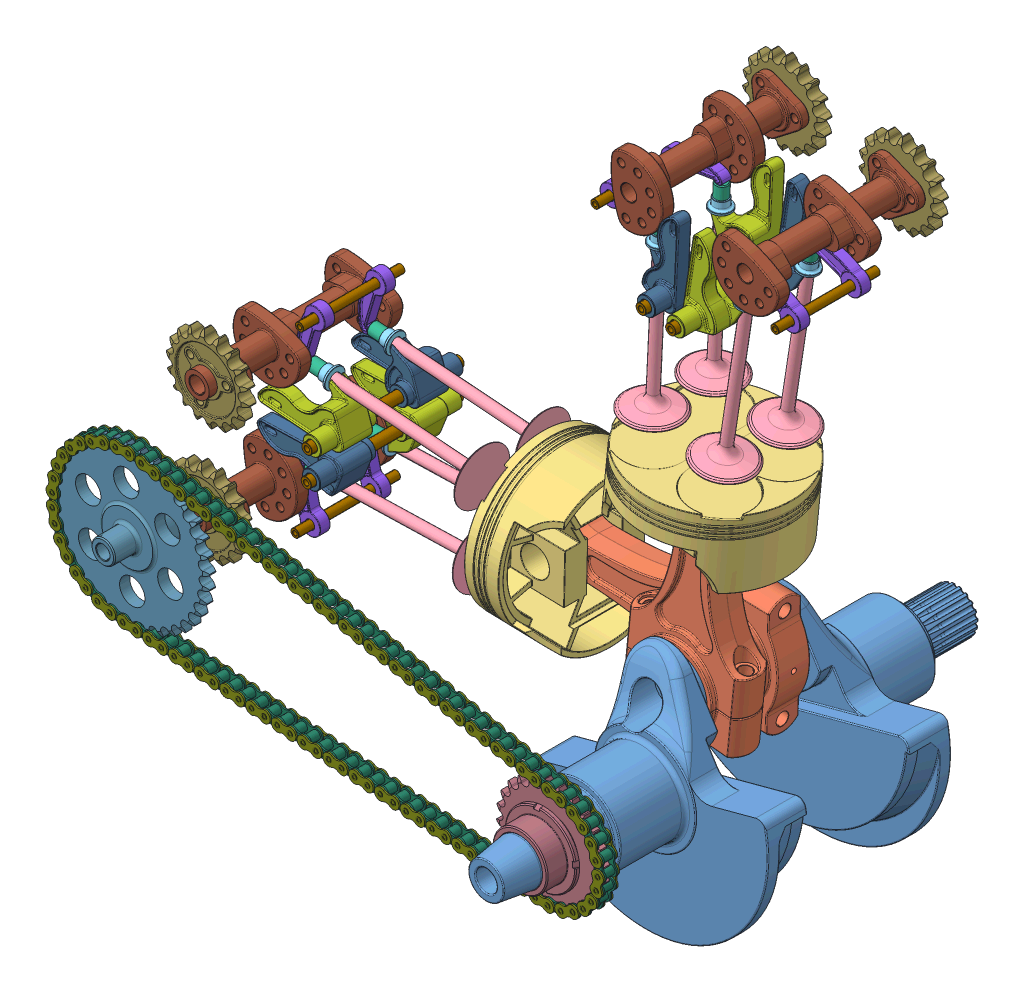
SolidWorks assembly Top Level Assembly.SLDASM, configuration Default (file format 7000). Lengths in mm.
Overall size (642.54 685.71 462).
171 component instances, 16 part files, 41 mates.
Components (placement in the parent):
- Flywheel Final-1: Flywheel Final.SLDPRT [Taper Shaft] x (0.965926 0.258819 0) z (0 0 1) size (239.43 220 247)
- Conrod Final-1: Conrod Final.SLDPRT [ConRod Cup] at (-15.5291 57.9555 -64) x (0.994894 -0.100925 0) z (0 0 1) size (117 45 42.18)
- Conrod Final-2: Conrod Final.SLDPRT [ConRod] at (-15.5291 57.9555 -64) x (0.994894 -0.100925 0) z (0 0 1) size (117.32 192.67 42.18)
- Flywheel Final-2: Flywheel Final.SLDPRT [Spline Shaft] at (0 0 -180) x (-0.965926 -0.258819 0) z (0 0 -1) size (239.43 220 215)
- Conrod Final-5: Conrod Final.SLDPRT [ConRod Cup] at (-15.5291 57.9555 -116) x (-0.024908 -0.99969 0) z (0 0 -1) size (117 45 42.18)
- Conrod Final-6: Conrod Final.SLDPRT [ConRod] at (-15.5291 57.9555 -116) x (-0.024908 -0.99969 0) z (0 0 -1) size (117.32 192.67 42.18)
- Piston and Cam Shaft Assembly-1: Piston and Cam Shaft Assembly.SLDASM [Default] at (5.0495 260.8144 -64) x (0 0 1) z (-0.994894 0.100925 0) size (194 330.08 197.81)
  - Piston Final-1: Piston Final.SLDPRT [Default] at origin size (150 71.75 150)
  - Cam Assembly-1: Cam Assembly.SLDASM [Default] at (-257.3157 -28.0716 56.7677) size (194 233.48 197.81) (flexible)
    - Single Valves and Rockers-1: Single Valves and Rockers.SLDASM [Default] at (257.3157 26.5178 -56.6862) size (150 200.16 97.47)
      - Valve Final-5: Valve Final.SLDPRT [Default] at (30 29.9426 -35.6104) x (-0.948904 -0.016515 -0.315132) z (0.315564 -0.049662 -0.947604) size (54 165 54)
      - Valve Final-6: Valve Final.SLDPRT [Default] at (-30 29.9426 -35.6104) x (0.997243 -0.003884 -0.07411) z (0.074211 0.052192 0.995876) size (54 165 54)
      - Closing Shim-6: Closing Shim.SLDPRT [Default] at (-30 174.7439 -43.1991) x (0.92869 -0.019409 -0.370348) z (0.370856 0.048604 0.927418) size (20 10 20)
      - Closing Shim-7: Closing Shim.SLDPRT [Default] at (30 174.7439 -43.1991) x (0.998232 -0.003111 -0.059362) z (0.059443 0.052243 0.996864) size (20 10 20)
      - Opening Shim-5: Opening Shim.SLDPRT [Default] at (-30 184.7302 -43.7225) x (1 0 0) z (0 0.052336 0.99863) size (12 13 12)
      - Opening Shim-6: Opening Shim.SLDPRT [Default] at (30 184.7302 -43.7225) x (1 0 0) z (0 0.052336 0.99863) size (12 13 12)
      - Closing Rocker Arm_A-3: Closing Rocker Arm_A.sldprt [Default] at (45 156.8153 -14.6663) x (0 -0.052336 -0.99863) z (1 0 0) size (41.82 83.99 55)
      - Opening Rocker Arm-3: Opening Rocker Arm.sldprt [Default] at (-30 191.0023 -88.9874) x (0 0 1) z (-1 0 0) size (59.04 26.83 10.34)
      - Rocker Shafts-3: Rocker Shafts.SLDPRT [Closing Rocker Shaft] at (0 156.8153 -14.6663) x (0 0 -1) z (1 0 0) size (10 10 150)
      - Closing Rocker Arm_B-4: Closing Rocker Arm_B.sldprt [Default] at (-45 152.4639 -2.1604) x (0 -0.052336 -0.99863) z (1 0 0) size (41.82 83.99 55)
      - Opening Rocker Arm-4: Opening Rocker Arm.sldprt [Default] at (30 191.0023 -88.9874) x (0 0 1) z (-1 0 0) size (59.04 26.83 10.34)
      - Rocker Shafts-4: Rocker Shafts.SLDPRT [Opening Rocker Shaft] at (0 191.0023 -88.9874) x (0 -0.694346 -0.719642) z (1 0 0) size (8 8 100)
    - Single Valves and Rockers-2: Single Valves and Rockers.SLDASM [Default] at (257.3157 26.5178 -56.8491) x (-1 0 0) z (0 0 -1) size (150 200.16 97.47)
      - Valve Final-5: Valve Final.SLDPRT [Default] at (30 29.9426 -35.6104) x (-0.948904 -0.016515 -0.315132) z (0.315564 -0.049662 -0.947604) size (54 165 54)
      - Valve Final-6: Valve Final.SLDPRT [Default] at (-30 29.9426 -35.6104) x (0.997243 -0.003884 -0.07411) z (0.074211 0.052192 0.995876) size (54 165 54)
      - Closing Shim-6: Closing Shim.SLDPRT [Default] at (-30 174.7439 -43.1991) x (0.92869 -0.019409 -0.370348) z (0.370856 0.048604 0.927418) size (20 10 20)
      - Closing Shim-7: Closing Shim.SLDPRT [Default] at (30 174.7439 -43.1991) x (0.998232 -0.003111 -0.059362) z (0.059443 0.052243 0.996864) size (20 10 20)
      - Opening Shim-5: Opening Shim.SLDPRT [Default] at (-30 184.7302 -43.7225) x (1 0 0) z (0 0.052336 0.99863) size (12 13 12)
      - Opening Shim-6: Opening Shim.SLDPRT [Default] at (30 184.7302 -43.7225) x (1 0 0) z (0 0.052336 0.99863) size (12 13 12)
      - Closing Rocker Arm_A-3: Closing Rocker Arm_A.sldprt [Default] at (45 156.8153 -14.6663) x (0 -0.052336 -0.99863) z (1 0 0) size (41.82 83.99 55)
      - Opening Rocker Arm-3: Opening Rocker Arm.sldprt [Default] at (-30 191.0023 -88.9874) x (0 0 1) z (-1 0 0) size (59.04 26.83 10.34)
      - Rocker Shafts-3: Rocker Shafts.SLDPRT [Closing Rocker Shaft] at (0 156.8153 -14.6663) x (0 0 -1) z (1 0 0) size (10 10 150)
      - Closing Rocker Arm_B-4: Closing Rocker Arm_B.sldprt [Default] at (-45 152.4639 -2.1604) x (0 -0.052336 -0.99863) z (1 0 0) size (41.82 83.99 55)
      - Opening Rocker Arm-4: Opening Rocker Arm.sldprt [Default] at (30 191.0023 -88.9874) x (0 0 1) z (-1 0 0) size (59.04 26.83 10.34)
      - Rocker Shafts-4: Rocker Shafts.SLDPRT [Opening Rocker Shaft] at (0 191.0023 -88.9874) x (0 -0.694346 -0.719642) z (1 0 0) size (8 8 100)
    - Camshaft Final-2: Camshaft Final.SLDPRT [Default] at (296.3157 248.3099 -114.2566) x (0 -0.958311 0.285728) z (1 0 0) size (53.08 66.16 170)
    - Camshaft Final-3: Camshaft Final.SLDPRT [Default] at (296.3157 248.3099 0.7213) x (0 0.231707 -0.972786) z (1 0 0) size (53.08 66.16 170)
- Piston and Cam Shaft Assembly-2: Piston and Cam Shaft Assembly.SLDASM [Default] at (-219.3659 63.0343 -116) x (0 0 -1) z (0.024908 0.99969 0) size (194 330.08 197.81)
  - Piston Final-1: Piston Final.SLDPRT [Default] at origin size (150 71.75 150)
  - Cam Assembly-1: Cam Assembly.SLDASM [Default] at (-257.3157 -28.0716 56.7677) size (194 233.48 197.81) (flexible)
    - Single Valves and Rockers-1: Single Valves and Rockers.SLDASM [Default] at (257.3157 26.5178 -56.6862) size (150 200.16 97.47)
      - Valve Final-5: Valve Final.SLDPRT [Default] at (30 29.9426 -35.6104) x (-0.948904 -0.016515 -0.315132) z (0.315564 -0.049662 -0.947604) size (54 165 54)
      - Valve Final-6: Valve Final.SLDPRT [Default] at (-30 29.9426 -35.6104) x (0.997243 -0.003884 -0.07411) z (0.074211 0.052192 0.995876) size (54 165 54)
      - Closing Shim-6: Closing Shim.SLDPRT [Default] at (-30 174.7439 -43.1991) x (0.92869 -0.019409 -0.370348) z (0.370856 0.048604 0.927418) size (20 10 20)
      - Closing Shim-7: Closing Shim.SLDPRT [Default] at (30 174.7439 -43.1991) x (0.998232 -0.003111 -0.059362) z (0.059443 0.052243 0.996864) size (20 10 20)
      - Opening Shim-5: Opening Shim.SLDPRT [Default] at (-30 184.7302 -43.7225) x (1 0 0) z (0 0.052336 0.99863) size (12 13 12)
      - Opening Shim-6: Opening Shim.SLDPRT [Default] at (30 184.7302 -43.7225) x (1 0 0) z (0 0.052336 0.99863) size (12 13 12)
      - Closing Rocker Arm_A-3: Closing Rocker Arm_A.sldprt [Default] at (45 156.8153 -14.6663) x (0 -0.052336 -0.99863) z (1 0 0) size (41.82 83.99 55)
      - Opening Rocker Arm-3: Opening Rocker Arm.sldprt [Default] at (-30 191.0023 -88.9874) x (0 0 1) z (-1 0 0) size (59.04 26.83 10.34)
      - Rocker Shafts-3: Rocker Shafts.SLDPRT [Closing Rocker Shaft] at (0 156.8153 -14.6663) x (0 0 -1) z (1 0 0) size (10 10 150)
      - Closing Rocker Arm_B-4: Closing Rocker Arm_B.sldprt [Default] at (-45 152.4639 -2.1604) x (0 -0.052336 -0.99863) z (1 0 0) size (41.82 83.99 55)
      - Opening Rocker Arm-4: Opening Rocker Arm.sldprt [Default] at (30 191.0023 -88.9874) x (0 0 1) z (-1 0 0) size (59.04 26.83 10.34)
      - Rocker Shafts-4: Rocker Shafts.SLDPRT [Opening Rocker Shaft] at (0 191.0023 -88.9874) x (0 -0.694346 -0.719642) z (1 0 0) size (8 8 100)
    - Single Valves and Rockers-2: Single Valves and Rockers.SLDASM [Default] at (257.3157 26.5178 -56.8491) x (-1 0 0) z (0 0 -1) size (150 200.16 97.47)
      - Valve Final-5: Valve Final.SLDPRT [Default] at (30 29.9426 -35.6104) x (-0.948904 -0.016515 -0.315132) z (0.315564 -0.049662 -0.947604) size (54 165 54)
      - Valve Final-6: Valve Final.SLDPRT [Default] at (-30 29.9426 -35.6104) x (0.997243 -0.003884 -0.07411) z (0.074211 0.052192 0.995876) size (54 165 54)
      - Closing Shim-6: Closing Shim.SLDPRT [Default] at (-30 174.7439 -43.1991) x (0.92869 -0.019409 -0.370348) z (0.370856 0.048604 0.927418) size (20 10 20)
      - Closing Shim-7: Closing Shim.SLDPRT [Default] at (30 174.7439 -43.1991) x (0.998232 -0.003111 -0.059362) z (0.059443 0.052243 0.996864) size (20 10 20)
      - Opening Shim-5: Opening Shim.SLDPRT [Default] at (-30 184.7302 -43.7225) x (1 0 0) z (0 0.052336 0.99863) size (12 13 12)
      - Opening Shim-6: Opening Shim.SLDPRT [Default] at (30 184.7302 -43.7225) x (1 0 0) z (0 0.052336 0.99863) size (12 13 12)
      - Closing Rocker Arm_A-3: Closing Rocker Arm_A.sldprt [Default] at (45 156.8153 -14.6663) x (0 -0.052336 -0.99863) z (1 0 0) size (41.82 83.99 55)
      - Opening Rocker Arm-3: Opening Rocker Arm.sldprt [Default] at (-30 191.0023 -88.9874) x (0 0 1) z (-1 0 0) size (59.04 26.83 10.34)
      - Rocker Shafts-3: Rocker Shafts.SLDPRT [Closing Rocker Shaft] at (0 156.8153 -14.6663) x (0 0 -1) z (1 0 0) size (10 10 150)
      - Closing Rocker Arm_B-4: Closing Rocker Arm_B.sldprt [Default] at (-45 152.4639 -2.1604) x (0 -0.052336 -0.99863) z (1 0 0) size (41.82 83.99 55)
      - Opening Rocker Arm-4: Opening Rocker Arm.sldprt [Default] at (30 191.0023 -88.9874) x (0 0 1) z (-1 0 0) size (59.04 26.83 10.34)
      - Rocker Shafts-4: Rocker Shafts.SLDPRT [Opening Rocker Shaft] at (0 191.0023 -88.9874) x (0 -0.694346 -0.719642) z (1 0 0) size (8 8 100)
    - Camshaft Final-2: Camshaft Final.SLDPRT [Default] at (296.3157 248.3099 -114.2566) x (0 -0.958311 0.285728) z (1 0 0) size (53.08 66.16 170)
    - Camshaft Final-3: Camshaft Final.SLDPRT [Default] at (296.3157 248.3099 0.7213) x (0 0.231707 -0.972786) z (1 0 0) size (53.08 66.16 170)
- Cam Gear Outer-1: Cam Gear Outer.sldprt [Default] at (84.4724 474.1261 -169) x (-0.92458 0.380987 0) z (0 0 -1) size (80.56 81.63 12)
- Cam Gear Outer-2: Cam Gear Outer.sldprt [Default] at (-29.9184 485.7303 -169) x (-0.92458 0.380987 0) z (0 0 -1) size (80.56 81.63 12)
- Cam Gear Outer-4: Cam Gear Outer.sldprt [Default] at (-438.1039 125.991 -11) x (0.966712 -0.255865 0) z (0 0 1) size (80.56 81.63 12)
- Cam Gear Outer-5: Cam Gear Outer.sldprt [Default] at (-440.9678 11.0488 -11) x (0.966712 -0.255865 0) z (0 0 1) size (80.56 81.63 12)
- Chain Assembly-1: Chain Assembly.SLDASM [Default] at (0 0 91) x (0.998355 0.057327 0) z (0 0 1) size (545.6 215.15 53)
  - Sprocket Small-2: Sprocket Small.SLDPRT [Default] x (0.998956 0.045675 0) z (0 0 1) size (105.84 105.84 53)
  - Sprocket Large-2: Sprocket Large.SLDPRT [Default] at (-407.7257 80 0) x (0.99997 0.007723 0) z (0 0 1) size (154.33 154.33 51)
  - Chain Link Inner-1: Chain Link Inner.SLDPRT [Default] at (-296.9967 126.72 0) x (0.968404 -0.249386 0) z (0 0 1) size (24.21 11.51 13)
  - Chain Link Outer-1: Chain Link Outer.SLDPRT [Default] at (-284.698 123.5528 0) x (0.968404 -0.249386 0) z (0 0 1) size (24.2 11.5 17)
  - Chain Link Inner-28: Chain Link Inner.SLDPRT [Default] at (-321.5943 133.0544 0) x (0.968404 -0.249386 0) z (0 0 1) size (24.21 11.51 13)
  - Chain Link Inner-29: Chain Link Inner.SLDPRT [Default] at (-346.1903 139.3884 0) x (0.968404 -0.249386 0) z (0 0 1) size (24.21 11.51 13)
  - Chain Link Inner-30: Chain Link Inner.SLDPRT [Default] at (-370.7884 145.723 0) x (0.968404 -0.249386 0) z (0 0 1) size (24.21 11.51 13)
  - Chain Link Inner-31: Chain Link Inner.SLDPRT [Default] at (-395.4395 151.8244 0) x (0.9851 -0.17198 0) z (0 0 1) size (24.21 11.51 13)
  - Chain Link Inner-32: Chain Link Inner.SLDPRT [Default] at (-420.7229 152.0238 0) x (0.987542 0.157357 0) z (0 0 1) size (24.21 11.51 13)
  - Chain Link Inner-33: Chain Link Inner.SLDPRT [Default] at (-444.6188 143.8052 0) x (0.872827 0.48803 0) z (0 0 1) size (24.21 11.51 13)
  - Chain Link Inner-34: Chain Link Inner.SLDPRT [Default] at (-463.9737 127.5904 0) x (0.632224 0.774786 0) z (0 0 1) size (24.21 11.51 13)
  - Chain Link Inner-35: Chain Link Inner.SLDPRT [Default] at (-476.1633 105.4564 0) x (0.326144 0.94532 0) z (0 0 1) size (24.21 11.51 13)
  - Chain Link Inner-36: Chain Link Inner.SLDPRT [Default] at (-480.7851 80.5739 0) x (0.033588 0.999436 0) z (0 0 1) size (24.21 11.51 13)
  - Chain Link Inner-37: Chain Link Inner.SLDPRT [Default] at (-477.2647 55.5543 0) x (-0.316746 0.94851 0) z (0 0 1) size (24.21 11.51 13)
  - Chain Link Inner-38: Chain Link Inner.SLDPRT [Default] at (-464.9092 33.5332 0) x (-0.642872 0.765974 0) z (0 0 1) size (24.21 11.51 13)
  - Chain Link Inner-39: Chain Link Inner.SLDPRT [Default] at (-445.501 17.351 0) x (-0.866485 0.499204 0) z (0 0 1) size (24.21 11.51 13)
  - Chain Link Inner-40: Chain Link Inner.SLDPRT [Default] at (-421.8104 8.5113 0) x (-0.981598 0.19096 0) z (0 0 1) size (24.21 11.51 13)
  - Chain Link Inner-41: Chain Link Inner.SLDPRT [Default] at (-396.6619 4.9605 0) x (-0.99084 0.135038 0) z (0 0 1) size (24.21 11.51 13)
  - Chain Link Inner-42: Chain Link Inner.SLDPRT [Default] at (-371.4939 1.5304 0) x (-0.99084 0.135038 0) z (0 0 1) size (24.21 11.51 13)
  - Chain Link Inner-43: Chain Link Inner.SLDPRT [Default] at (-346.328 -1.8993 0) x (-0.99084 0.135038 0) z (0 0 1) size (24.21 11.51 13)
  - Chain Link Inner-44: Chain Link Inner.SLDPRT [Default] at (-321.16 -5.3294 0) x (-0.99084 0.135038 0) z (0 0 1) size (24.21 11.51 13)
  - Chain Link Inner-45: Chain Link Inner.SLDPRT [Default] at (-295.992 -8.7594 0) x (-0.99084 0.135038 0) z (0 0 1) size (24.21 11.51 13)
  - Chain Link Inner-46: Chain Link Inner.SLDPRT [Default] at (-270.8262 -12.1892 0) x (-0.99084 0.135038 0) z (0 0 1) size (24.21 11.51 13)
  - Chain Link Inner-47: Chain Link Inner.SLDPRT [Default] at (-245.6582 -15.6192 0) x (-0.99084 0.135038 0) z (0 0 1) size (24.21 11.51 13)
  - Chain Link Inner-48: Chain Link Inner.SLDPRT [Default] at (-220.4902 -19.0493 0) x (-0.99084 0.135038 0) z (0 0 1) size (24.21 11.51 13)
  - Chain Link Inner-49: Chain Link Inner.SLDPRT [Default] at (-195.3222 -22.4793 0) x (-0.99084 0.135038 0) z (0 0 1) size (24.21 11.51 13)
  - Chain Link Inner-50: Chain Link Inner.SLDPRT [Default] at (-170.1564 -25.9091 0) x (-0.99084 0.135038 0) z (0 0 1) size (24.21 11.51 13)
  - Chain Link Inner-51: Chain Link Inner.SLDPRT [Default] at (-144.9884 -29.3391 0) x (-0.99084 0.135038 0) z (0 0 1) size (24.21 11.51 13)
  - Chain Link Inner-52: Chain Link Inner.SLDPRT [Default] at (-119.8204 -32.7692 0) x (-0.99084 0.135038 0) z (0 0 1) size (24.21 11.51 13)
  - Chain Link Inner-53: Chain Link Inner.SLDPRT [Default] at (-94.6546 -36.1989 0) x (-0.99084 0.135038 0) z (0 0 1) size (24.21 11.51 13)
  - Chain Link Outer-81: Chain Link Outer.SLDPRT [Default] at (-309.2956 129.8872 0) x (0.968404 -0.249386 0) z (0 0 1) size (24.2 11.5 17)
  - Chain Link Outer-82: Chain Link Outer.SLDPRT [Default] at (-333.8915 136.2212 0) x (0.968404 -0.249386 0) z (0 0 1) size (24.2 11.5 17)
  - Chain Link Outer-83: Chain Link Outer.SLDPRT [Default] at (-358.4896 142.5558 0) x (0.968404 -0.249386 0) z (0 0 1) size (24.2 11.5 17)
  - Chain Link Outer-84: Chain Link Outer.SLDPRT [Default] at (-383.0866 148.8901 0) x (0.968404 -0.249386 0) z (0 0 1) size (24.2 11.5 17)
  - Chain Link Outer-85: Chain Link Outer.SLDPRT [Default] at (-408.0734 152.9694 0) x (0.999967 -0.008128 0) z (0 0 1) size (24.2 11.5 17)
  - Chain Link Outer-86: Chain Link Outer.SLDPRT [Default] at (-433.0341 148.9673 0) x (0.94607 0.323963 0) z (0 0 1) size (24.2 11.5 17)
  - Chain Link Outer-87: Chain Link Outer.SLDPRT [Default] at (-455.0644 136.614 0) x (0.766808 0.641877 0) z (0 0 1) size (24.2 11.5 17)
  - Chain Link Outer-88: Chain Link Outer.SLDPRT [Default] at (-471.0484 117.065 0) x (0.48024 0.877137 0) z (0 0 1) size (24.2 11.5 17)
  - Chain Link Outer-89: Chain Link Outer.SLDPRT [Default] at (-479.3816 93.1835 0) x (0.183322 0.983053 0) z (0 0 1) size (24.2 11.5 17)
  - Chain Link Outer-90: Chain Link Outer.SLDPRT [Default] at (-480.145 67.9046 0) x (-0.137073 0.990561 0) z (0 0 1) size (24.2 11.5 17)
  - Chain Link Outer-91: Chain Link Outer.SLDPRT [Default] at (-472.1278 43.9598 0) x (-0.489797 0.871837 0) z (0 0 1) size (24.2 11.5 17)
  - Chain Link Outer-92: Chain Link Outer.SLDPRT [Default] at (-455.9144 24.5919 0) x (-0.768903 0.639365 0) z (0 0 1) size (24.2 11.5 17)
  - Chain Link Outer-93: Chain Link Outer.SLDPRT [Default] at (-434.0212 11.9528 0) x (-0.936954 0.349454 0) z (0 0 1) size (24.2 11.5 17)
  - Chain Link Outer-94: Chain Link Outer.SLDPRT [Default] at (-409.2448 6.6754 0) x (-0.99084 0.135038 0) z (0 0 1) size (24.2 11.5 17)
  - Chain Link Outer-95: Chain Link Outer.SLDPRT [Default] at (-384.0775 3.2454 0) x (-0.99084 0.135038 0) z (0 0 1) size (24.2 11.5 17)
  - Chain Link Outer-96: Chain Link Outer.SLDPRT [Default] at (-358.9117 -0.1843 0) x (-0.99084 0.135038 0) z (0 0 1) size (24.2 11.5 17)
  - Chain Link Outer-97: Chain Link Outer.SLDPRT [Default] at (-333.7437 -3.6144 0) x (-0.99084 0.135038 0) z (0 0 1) size (24.2 11.5 17)
  - Chain Link Outer-98: Chain Link Outer.SLDPRT [Default] at (-308.5757 -7.0444 0) x (-0.99084 0.135038 0) z (0 0 1) size (24.2 11.5 17)
  - Chain Link Outer-99: Chain Link Outer.SLDPRT [Default] at (-283.4099 -10.4742 0) x (-0.99084 0.135038 0) z (0 0 1) size (24.2 11.5 17)
  - Chain Link Outer-100: Chain Link Outer.SLDPRT [Default] at (-258.2419 -13.9042 0) x (-0.99084 0.135038 0) z (0 0 1) size (24.2 11.5 17)
  - Chain Link Outer-101: Chain Link Outer.SLDPRT [Default] at (-233.0739 -17.3343 0) x (-0.99084 0.135038 0) z (0 0 1) size (24.2 11.5 17)
  - Chain Link Outer-102: Chain Link Outer.SLDPRT [Default] at (-207.9059 -20.7643 0) x (-0.99084 0.135038 0) z (0 0 1) size (24.2 11.5 17)
  - Chain Link Outer-103: Chain Link Outer.SLDPRT [Default] at (-182.7401 -24.1941 0) x (-0.99084 0.135038 0) z (0 0 1) size (24.2 11.5 17)
  - Chain Link Outer-104: Chain Link Outer.SLDPRT [Default] at (-157.5721 -27.6241 0) x (-0.99084 0.135038 0) z (0 0 1) size (24.2 11.5 17)
  - Chain Link Outer-105: Chain Link Outer.SLDPRT [Default] at (-132.4041 -31.0542 0) x (-0.99084 0.135038 0) z (0 0 1) size (24.2 11.5 17)
  - Chain Link Outer-106: Chain Link Outer.SLDPRT [Default] at (-107.2382 -34.4839 0) x (-0.99084 0.135038 0) z (0 0 1) size (24.2 11.5 17)
  - Chain Link Inner-54: Chain Link Inner.SLDPRT [Default] at (-69.4866 -39.629 0) x (-0.99084 0.135038 0) z (0 0 1) size (24.21 11.51 13)
  - Chain Link Inner-55: Chain Link Inner.SLDPRT [Default] at (-44.3186 -43.059 0) x (-0.99084 0.135038 0) z (0 0 1) size (24.21 11.51 13)
  - Chain Link Inner-56: Chain Link Inner.SLDPRT [Default] at (-19.1518 -46.4889 0) x (-0.99084 0.135038 0) z (0 0 1) size (24.21 11.51 13)
  - Chain Link Inner-57: Chain Link Inner.SLDPRT [Default] at (6.0997 -48.4355 0) x (-0.995056 -0.099318 0) z (0 0 1) size (24.21 11.51 13)
  - Chain Link Inner-58: Chain Link Inner.SLDPRT [Default] at (29.7963 -40.0164 0) x (-0.831452 -0.555596 0) z (0 0 1) size (24.21 11.51 13)
  - Chain Link Inner-59: Chain Link Inner.SLDPRT [Default] at (46.3626 -21.1515 0) x (-0.437817 -0.899064 0) z (0 0 1) size (24.21 11.51 13)
  - Chain Link Inner-60: Chain Link Inner.SLDPRT [Default] at (50.8144 3.5299 0) x (0.096024 -0.995379 0) z (0 0 1) size (24.21 11.51 13)
  - Chain Link Inner-61: Chain Link Inner.SLDPRT [Default] at (41.8953 26.9986 0) x (0.584054 -0.811715 0) z (0 0 1) size (24.21 11.51 13)
  - Chain Link Inner-62: Chain Link Inner.SLDPRT [Default] at (22.6637 43.2037 0) x (0.896382 -0.443283 0) z (0 0 1) size (24.21 11.51 13)
  - Chain Link Inner-63: Chain Link Inner.SLDPRT [Default] at (-1.568 50.6403 0) x (0.968404 -0.249386 0) z (0 0 1) size (24.21 11.51 13)
  - Chain Link Inner-64: Chain Link Inner.SLDPRT [Default] at (-26.1648 56.9745 0) x (0.968404 -0.249386 0) z (0 0 1) size (24.21 11.51 13)
  - Chain Link Inner-65: Chain Link Inner.SLDPRT [Default] at (-50.7629 63.3091 0) x (0.968404 -0.249386 0) z (0 0 1) size (24.21 11.51 13)
  - Chain Link Inner-66: Chain Link Inner.SLDPRT [Default] at (-75.361 69.6437 0) x (0.968404 -0.249386 0) z (0 0 1) size (24.21 11.51 13)
  - Chain Link Inner-67: Chain Link Inner.SLDPRT [Default] at (-99.9569 75.9777 0) x (0.968404 -0.249386 0) z (0 0 1) size (24.21 11.51 13)
  - Chain Link Inner-68: Chain Link Inner.SLDPRT [Default] at (-124.555 82.3123 0) x (0.968404 -0.249386 0) z (0 0 1) size (24.21 11.51 13)
  - Chain Link Inner-69: Chain Link Inner.SLDPRT [Default] at (-149.1531 88.6469 0) x (0.968404 -0.249386 0) z (0 0 1) size (24.21 11.51 13)
  - Chain Link Inner-70: Chain Link Inner.SLDPRT [Default] at (-173.7502 94.9812 0) x (0.968404 -0.249386 0) z (0 0 1) size (24.21 11.51 13)
  - Chain Link Inner-71: Chain Link Inner.SLDPRT [Default] at (-198.3472 101.3155 0) x (0.968404 -0.249386 0) z (0 0 1) size (24.21 11.51 13)
  - Chain Link Inner-72: Chain Link Inner.SLDPRT [Default] at (-222.9453 107.65 0) x (0.968404 -0.249386 0) z (0 0 1) size (24.21 11.51 13)
  - Chain Link Inner-73: Chain Link Inner.SLDPRT [Default] at (-247.5434 113.9846 0) x (0.968404 -0.249386 0) z (0 0 1) size (24.21 11.51 13)
  - Chain Link Inner-74: Chain Link Inner.SLDPRT [Default] at (-272.1394 120.3186 0) x (0.968404 -0.249386 0) z (0 0 1) size (24.21 11.51 13)
  - Chain Link Outer-107: Chain Link Outer.SLDPRT [Default] at (-82.0703 -37.914 0) x (-0.99084 0.135038 0) z (0 0 1) size (24.2 11.5 17)
  - Chain Link Outer-108: Chain Link Outer.SLDPRT [Default] at (-56.9023 -41.344 0) x (-0.99084 0.135038 0) z (0 0 1) size (24.2 11.5 17)
  - Chain Link Outer-109: Chain Link Outer.SLDPRT [Default] at (-31.7353 -44.7739 0) x (-0.99084 0.135038 0) z (0 0 1) size (24.2 11.5 17)
  - Chain Link Outer-110: Chain Link Outer.SLDPRT [Default] at (-6.5684 -48.2039 0) x (-0.990842 0.135027 0) z (0 0 1) size (24.2 11.5 17)
  - Chain Link Outer-111: Chain Link Outer.SLDPRT [Default] at (18.4675 -45.6814 0) x (-0.942769 -0.333445 0) z (0 0 1) size (24.2 11.5 17)
  - Chain Link Outer-112: Chain Link Outer.SLDPRT [Default] at (39.3354 -31.6842 0) x (-0.661029 -0.75036 0) z (0 0 1) size (24.2 11.5 17)
  - Chain Link Outer-113: Chain Link Outer.SLDPRT [Default] at (50.2974 -9.1188 0) x (-0.17748 -0.984124 0) z (0 0 1) size (24.2 11.5 17)
  - Chain Link Outer-114: Chain Link Outer.SLDPRT [Default] at (47.9132 15.8548 0) x (0.356765 -0.934194 0) z (0 0 1) size (24.2 11.5 17)
  - Chain Link Outer-115: Chain Link Outer.SLDPRT [Default] at (33.2717 36.2787 0) x (0.76568 -0.643222 0) z (0 0 1) size (24.2 11.5 17)
  - Chain Link Outer-116: Chain Link Outer.SLDPRT [Default] at (10.731 47.473 0) x (0.968404 -0.249386 0) z (0 0 1) size (24.2 11.5 17)
  - Chain Link Outer-117: Chain Link Outer.SLDPRT [Default] at (-13.866 53.8073 0) x (0.968404 -0.249386 0) z (0 0 1) size (24.2 11.5 17)
  - Chain Link Outer-118: Chain Link Outer.SLDPRT [Default] at (-38.4641 60.1419 0) x (0.968404 -0.249386 0) z (0 0 1) size (24.2 11.5 17)
  - Chain Link Outer-119: Chain Link Outer.SLDPRT [Default] at (-63.0622 66.4765 0) x (0.968404 -0.249386 0) z (0 0 1) size (24.2 11.5 17)
  - Chain Link Outer-120: Chain Link Outer.SLDPRT [Default] at (-87.6582 72.8105 0) x (0.968404 -0.249386 0) z (0 0 1) size (24.2 11.5 17)
  - Chain Link Outer-121: Chain Link Outer.SLDPRT [Default] at (-112.2563 79.1451 0) x (0.968404 -0.249386 0) z (0 0 1) size (24.2 11.5 17)
  - Chain Link Outer-122: Chain Link Outer.SLDPRT [Default] at (-136.8544 85.4796 0) x (0.968404 -0.249386 0) z (0 0 1) size (24.2 11.5 17)
  - Chain Link Outer-123: Chain Link Outer.SLDPRT [Default] at (-161.4514 91.8139 0) x (0.968404 -0.249386 0) z (0 0 1) size (24.2 11.5 17)
  - Chain Link Outer-124: Chain Link Outer.SLDPRT [Default] at (-186.0485 98.1482 0) x (0.968404 -0.249386 0) z (0 0 1) size (24.2 11.5 17)
  - Chain Link Outer-125: Chain Link Outer.SLDPRT [Default] at (-210.6466 104.4828 0) x (0.968404 -0.249386 0) z (0 0 1) size (24.2 11.5 17)
  - Chain Link Outer-126: Chain Link Outer.SLDPRT [Default] at (-235.2447 110.8174 0) x (0.968404 -0.249386 0) z (0 0 1) size (24.2 11.5 17)
  - Chain Link Outer-127: Chain Link Outer.SLDPRT [Default] at (-259.8407 117.1514 0) x (0.968404 -0.249386 0) z (0 0 1) size (24.2 11.5 17)
Mates (geometry in assembly coordinates):
- Coincident1: coincident aligned: plane of Flywheel Final-1 through (0 0 0) normal (0 0 1); plane of assembly through (0 0 0) normal (0 0 1)
- Angle1: planar angle = 0.261799 rad aligned: plane of Flywheel Final-1 through (0 0 -308.3282) normal (-0.258819 0.965926 0); plane of assembly through (0 0 0) normal (0 1 0)
- Coincident2: coincident: point of Flywheel Final-1; point of assembly
- Concentric1: concentric anti-aligned: cylinder of Flywheel Final-1 through (-15.5291 57.9555 -90) axis (0 0 1) radius 30; cylinder of Conrod Final-1 through (-15.5291 57.9555 -43) axis (0 0 -1) radius 32.5
- Distance1: distance = 3 mm anti-aligned: plane of Conrod Final-1 through (-15.5291 57.9555 -43) normal (0 0 1); plane of Flywheel Final-1 through (0 0 -40) normal (0 0 -1)
- Concentric2: concentric anti-aligned: cylinder of Flywheel Final-1 through (-15.5291 57.9555 -90) axis (0 0 1) radius 30; cylinder of Conrod Final-2 through (-15.5291 57.9555 -43) axis (0 0 -1) radius 32.5
- Distance2: distance = 3 mm anti-aligned: plane of Conrod Final-2 through (-15.5291 57.9555 -43) normal (0 0 1); plane of Flywheel Final-1 through (0 0 -40) normal (0 0 -1)
- Coincident4: coincident anti-aligned: plane of Conrod Final-1 through (-15.5291 57.9555 -64) normal (0.100925 0.994894 0); plane of Conrod Final-2 through (-15.5291 57.9555 -64) normal (-0.100925 -0.994894 0)
- Concentric3: concentric anti-aligned: cylinder of Flywheel Final-1 through (-15.5291 57.9555 -90) axis (0 0 1) radius 30; cylinder of Flywheel Final-2 through (-15.5291 57.9555 -90) axis (0 0 -1) radius 30
- Coincident5: coincident anti-aligned: plane of Flywheel Final-1 through (-15.5291 57.9555 -90) normal (0 0 -1); plane of Flywheel Final-2 through (-15.5291 57.9555 -90) normal (0 0 1)
- Parallel1: parallel aligned: plane of Flywheel Final-1 through (0 0 -308.3282) normal (-0.258819 0.965926 0); plane of Flywheel Final-2 through (0 0 128.3282) normal (-0.258819 0.965926 0)
- Concentric6: concentric anti-aligned: cylinder of Flywheel Final-2 through (-15.5291 57.9555 -90) axis (0 0 -1) radius 30; cylinder of Conrod Final-5 through (-15.5291 57.9555 -137) axis (0 0 1) radius 32.5
- Distance5: distance = 3 mm anti-aligned: plane of Conrod Final-5 through (-15.5291 57.9555 -137) normal (0 0 -1); plane of Flywheel Final-2 through (0 0 -140) normal (0 0 1)
- Concentric7: concentric anti-aligned: cylinder of Flywheel Final-2 through (-15.5291 57.9555 -90) axis (0 0 -1) radius 30; cylinder of Conrod Final-6 through (-15.5291 57.9555 -137) axis (0 0 1) radius 32.5
- Distance6: distance = 3 mm anti-aligned: plane of Conrod Final-6 through (-15.5291 57.9555 -137) normal (0 0 -1); plane of Flywheel Final-2 through (0 0 -140) normal (0 0 1)
- Coincident6: coincident anti-aligned: plane of Conrod Final-5 through (-15.5291 57.9555 -116) normal (-0.99969 0.024908 0); plane of Conrod Final-6 through (-15.5291 57.9555 -116) normal (0.99969 -0.024908 0)
- Concentric8: concentric anti-aligned: cylinder of Conrod Final-2 through (1.6281 227.0875 -43) axis (0 0 -1) radius 14.6716; cylinder of Piston and Cam Shaft Assembly-1/Piston Final-1 through (1.6281 227.0875 -142.8151) axis (0 0 1) radius 13.9
- Parallel2: parallel aligned: plane of Conrod Final-2 through (34.0135 85.5966 -64) normal (0.100925 0.994894 0); plane of Piston and Cam Shaft Assembly-1/Piston Final-1 through (5.0495 260.8144 -64) normal (0.100925 0.994894 0)
- Width1: width anti-aligned: plane of Conrod Final-2 through (18.8916 122.3102 -48) normal (0 0 1); plane of Conrod Final-2 through (18.8916 122.3102 -80) normal (0 0 -1); plane of Piston and Cam Shaft Assembly-1/Piston Final-1 through (-14.8929 306.9818 -103.5) normal (0 0 -1); plane of Piston and Cam Shaft Assembly-1/Piston Final-1 through (-14.8929 306.9818 -24.5) normal (0 0 1)
- Concentric9: concentric anti-aligned: cylinder of Conrod Final-6 through (-185.4764 62.1899 -137) axis (0 0 1) radius 14.6716; cylinder of Piston and Cam Shaft Assembly-2/Piston Final-1 through (-185.4764 62.1899 -37.1849) axis (0 0 -1) radius 13.9
- Parallel3: parallel aligned: plane of Conrod Final-6 through (-46.8608 105.2506 -116) normal (-0.99969 0.024908 0); plane of Piston and Cam Shaft Assembly-2/Piston Final-1 through (-219.3659 63.0343 -116) normal (-0.99969 0.024908 0)
- Width2: width anti-aligned: plane of Conrod Final-6 through (-83.6994 31.8954 -100) normal (0 0 1); plane of Conrod Final-6 through (-83.6994 31.8954 -132) normal (0 0 -1); plane of Piston and Cam Shaft Assembly-2/Piston Final-1 through (-262.6609 88.6206 -155.5) normal (0 0 -1); plane of Piston and Cam Shaft Assembly-2/Piston Final-1 through (-262.6609 88.6206 -76.5) normal (0 0 1)
- Concentric10: concentric anti-aligned: cylinder of Piston and Cam Shaft Assembly-1/Cam Assembly-1/Camshaft Final-2 through (84.4724 474.1261 -183) axis (0 0 1) radius 12; cylinder of Cam Gear Outer-1 through (84.4724 474.1261 -163) axis (0 0 -1) radius 12
- Coincident7: coincident anti-aligned: plane of Piston and Cam Shaft Assembly-1/Cam Assembly-1/Camshaft Final-2 through (74.709 486.8019 -163) normal (0 0 -1); plane of Cam Gear Outer-1 through (84.4724 474.1261 -163) normal (0 0 1)
- Concentric11: concentric aligned: cylinder of Piston and Cam Shaft Assembly-1/Cam Assembly-1/Camshaft Final-2 through (105.2877 476.9054 -163) axis (0 0 -1) radius 3.5; cylinder of Cam Gear Outer-1 through (105.2877 476.9054 -163) axis (0 0 -1) radius 3.5
- Concentric12: concentric aligned: cylinder of Piston and Cam Shaft Assembly-1/Cam Assembly-1/Camshaft Final-2 through (71.6579 490.7631 -163) axis (0 0 -1) radius 3.5; cylinder of Cam Gear Outer-1 through (71.6579 490.7631 -163) axis (0 0 -1) radius 3.5
- Concentric13: concentric anti-aligned: cylinder of Piston and Cam Shaft Assembly-1/Cam Assembly-1/Camshaft Final-3 through (-29.9184 485.7303 -183) axis (0 0 1) radius 12; cylinder of Cam Gear Outer-2 through (-29.9184 485.7303 -163) axis (0 0 -1) radius 12
- Coincident8: coincident anti-aligned: plane of Piston and Cam Shaft Assembly-1/Cam Assembly-1/Camshaft Final-3 through (-36.0142 470.937 -163) normal (0 0 -1); plane of Cam Gear Outer-2 through (-29.9184 485.7303 -163) normal (0 0 1)
- Concentric14: concentric aligned: cylinder of Piston and Cam Shaft Assembly-1/Cam Assembly-1/Camshaft Final-3 through (-9.1031 488.5095 -163) axis (0 0 -1) radius 3.5; cylinder of Cam Gear Outer-2 through (-9.1031 488.5095 -163) axis (0 0 -1) radius 3.5
- Concentric15: concentric aligned: cylinder of Piston and Cam Shaft Assembly-1/Cam Assembly-1/Camshaft Final-3 through (-42.7329 502.3672 -163) axis (0 0 -1) radius 3.5; cylinder of Cam Gear Outer-2 through (-42.7329 502.3672 -163) axis (0 0 -1) radius 3.5
- Concentric17: concentric anti-aligned: cylinder of Piston and Cam Shaft Assembly-2/Cam Assembly-1/Camshaft Final-3 through (-438.1039 125.991 3) axis (0 0 -1) radius 12; cylinder of Cam Gear Outer-4 through (-438.1039 125.991 -17) axis (0 0 1) radius 12
- Coincident10: coincident anti-aligned: plane of Piston and Cam Shaft Assembly-2/Cam Assembly-1/Camshaft Final-3 through (-422.6618 130.1794 -17) normal (0 0 1); plane of Cam Gear Outer-4 through (-438.1039 125.991 -17) normal (0 0 -1)
- Concentric18: concentric aligned: cylinder of Piston and Cam Shaft Assembly-2/Cam Assembly-1/Camshaft Final-3 through (-452.9985 140.7948 -17) axis (0 0 1) radius 3.5; cylinder of Cam Gear Outer-4 through (-452.9985 140.7948 -17) axis (0 0 1) radius 3.5
- Concentric19: concentric aligned: cylinder of Piston and Cam Shaft Assembly-2/Cam Assembly-1/Camshaft Final-3 through (-417.8362 131.4882 -17) axis (0 0 1) radius 3.5; cylinder of Cam Gear Outer-4 through (-417.8362 131.4882 -17) axis (0 0 1) radius 3.5
- Concentric20: concentric anti-aligned: cylinder of Piston and Cam Shaft Assembly-2/Cam Assembly-1/Camshaft Final-2 through (-440.9678 11.0488 3) axis (0 0 -1) radius 12; cylinder of Cam Gear Outer-5 through (-440.9678 11.0488 -17) axis (0 0 1) radius 12
- Coincident11: coincident anti-aligned: plane of Piston and Cam Shaft Assembly-2/Cam Assembly-1/Camshaft Final-2 through (-452.316 22.3279 -17) normal (0 0 1); plane of Cam Gear Outer-5 through (-440.9678 11.0488 -17) normal (0 0 -1)
- Concentric21: concentric aligned: cylinder of Piston and Cam Shaft Assembly-2/Cam Assembly-1/Camshaft Final-2 through (-455.8623 25.8526 -17) axis (0 0 1) radius 3.5; cylinder of Cam Gear Outer-5 through (-455.8623 25.8526 -17) axis (0 0 1) radius 3.5
- Concentric22: concentric aligned: cylinder of Piston and Cam Shaft Assembly-2/Cam Assembly-1/Camshaft Final-2 through (-420.7 16.546 -17) axis (0 0 1) radius 3.5; cylinder of Cam Gear Outer-5 through (-420.7 16.546 -17) axis (0 0 1) radius 3.5
- Concentric23: concentric aligned: cylinder of Flywheel Final-1 through (0 0 125) axis (0 0 1) radius 22; cylinder of Chain Assembly-1/Sprocket Small-2 through (0 0 71) axis (0 0 1) radius 22
- Coincident12: coincident anti-aligned: plane of Flywheel Final-1 through (-8.7998 32.8415 71) normal (0 0 1); plane of Chain Assembly-1/Sprocket Small-2 through (0 0 71) normal (0 0 -1)
- Concentric24: concentric aligned: cylinder of Piston and Cam Shaft Assembly-2/Cam Assembly-1/Single Valves and Rockers-2/Closing Rocker Arm_A-3 through (-374.216 81.4818 -101) axis (0 0 1) radius 9; cylinder of Chain Assembly-1/Sprocket Large-2 through (-374.216 81.4818 71) axis (0 0 1) radius 12.5
